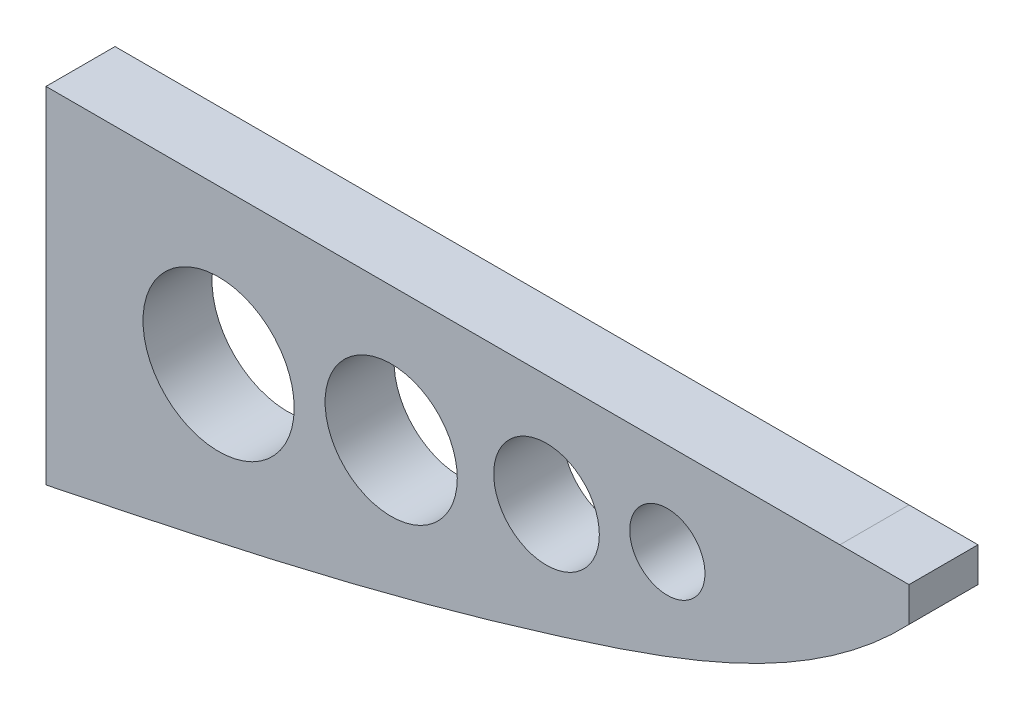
ISO-10303-21;
HEADER;
FILE_DESCRIPTION(('STEP AP214'),'2;1');
FILE_NAME('part.step','',(''),(''),'','','');
FILE_SCHEMA(('AUTOMOTIVE_DESIGN { 1 0 10303 214 1 1 1 1 }'));
ENDSEC;
DATA;
#1=APPLICATION_CONTEXT('core data for automotive mechanical design processes');
#2=APPLICATION_PROTOCOL_DEFINITION('international standard','automotive_design',2000,#1);
#3=PRODUCT_CONTEXT('',#1,'mechanical');
#4=PRODUCT('Part','Part','',(#3));
#5=PRODUCT_RELATED_PRODUCT_CATEGORY('part','',(#4));
#6=PRODUCT_DEFINITION_FORMATION('','',#4);
#7=PRODUCT_DEFINITION_CONTEXT('part definition',#1,'design');
#8=PRODUCT_DEFINITION('design','',#6,#7);
#9=PRODUCT_DEFINITION_SHAPE('','',#8);
#10=(LENGTH_UNIT() NAMED_UNIT(*) SI_UNIT(.MILLI.,.METRE.));
#11=(NAMED_UNIT(*) PLANE_ANGLE_UNIT() SI_UNIT($,.RADIAN.));
#12=(NAMED_UNIT(*) SI_UNIT($,.STERADIAN.) SOLID_ANGLE_UNIT());
#13=UNCERTAINTY_MEASURE_WITH_UNIT(LENGTH_MEASURE(1.E-05),#10,'distance_accuracy_value','');
#14=(GEOMETRIC_REPRESENTATION_CONTEXT(3) GLOBAL_UNCERTAINTY_ASSIGNED_CONTEXT((#13)) GLOBAL_UNIT_ASSIGNED_CONTEXT((#10,
#11,#12)) REPRESENTATION_CONTEXT('',''));
#15=CARTESIAN_POINT('',(0.,0.,0.));
#16=DIRECTION('',(0.,0.,1.));
#17=DIRECTION('',(1.,0.,0.));
#18=AXIS2_PLACEMENT_3D('',#15,#16,#17);
#19=CARTESIAN_POINT('',(0.,50.,20.));
#20=DIRECTION('',(0.,1.,0.));
#21=DIRECTION('',(0.,0.,1.));
#22=AXIS2_PLACEMENT_3D('',#19,#20,#21);
#23=PLANE('',#22);
#24=DIRECTION('',(1.,0.,0.));
#25=VECTOR('',#24,1.);
#26=CARTESIAN_POINT('',(0.,50.,0.));
#27=LINE('',#26,#25);
#28=CARTESIAN_POINT('',(230.,50.,0.));
#29=VERTEX_POINT('',#28);
#30=CARTESIAN_POINT('',(250.,50.,0.));
#31=VERTEX_POINT('',#30);
#32=EDGE_CURVE('E129',#29,#31,#27,.T.);
#33=ORIENTED_EDGE('',*,*,#32,.F.);
#34=DIRECTION('',(0.,0.,1.));
#35=VECTOR('',#34,1.);
#36=CARTESIAN_POINT('',(230.,50.,20.));
#37=LINE('',#36,#35);
#38=CARTESIAN_POINT('',(230.,50.,20.));
#39=VERTEX_POINT('',#38);
#40=EDGE_CURVE('E11',#29,#39,#37,.T.);
#41=ORIENTED_EDGE('',*,*,#40,.T.);
#42=DIRECTION('',(1.,0.,0.));
#43=VECTOR('',#42,1.);
#44=CARTESIAN_POINT('',(0.,50.,20.));
#45=LINE('',#44,#43);
#46=CARTESIAN_POINT('',(250.,50.,20.));
#47=VERTEX_POINT('',#46);
#48=EDGE_CURVE('E109',#39,#47,#45,.T.);
#49=ORIENTED_EDGE('',*,*,#48,.T.);
#50=DIRECTION('',(0.,0.,-1.));
#51=VECTOR('',#50,1.);
#52=CARTESIAN_POINT('',(250.,50.,20.));
#53=LINE('',#52,#51);
#54=EDGE_CURVE('E105',#47,#31,#53,.T.);
#55=ORIENTED_EDGE('',*,*,#54,.T.);
#56=EDGE_LOOP('',(#33,#41,#49,#55));
#57=FACE_BOUND('',#56,.T.);
#58=ADVANCED_FACE('F42',(#57),#23,.T.);
#59=CARTESIAN_POINT('',(0.,-50.,20.));
#60=CARTESIAN_POINT('',(33.4199486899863,-43.0608583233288,20.));
#61=CARTESIAN_POINT('',(83.9632555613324,-32.5541977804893,20.));
#62=CARTESIAN_POINT('',(169.944017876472,-7.88320989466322,20.));
#63=CARTESIAN_POINT('',(222.615387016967,11.374413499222,20.));
#64=CARTESIAN_POINT('',(250.,40.,20.));
#65=B_SPLINE_CURVE_WITH_KNOTS('',3,(#59,#60,#61,#62,#63,#64),.UNSPECIFIED.,.F.,.F.,(4,1,1,4),
(0.,0.381514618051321,0.575066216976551,1.),.UNSPECIFIED.);
#66=DIRECTION('',(0.,0.,-1.));
#67=VECTOR('',#66,1.);
#68=SURFACE_OF_LINEAR_EXTRUSION('',#65,#67);
#69=CARTESIAN_POINT('',(0.,-50.,0.));
#70=CARTESIAN_POINT('',(33.4199486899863,-43.0608583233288,0.));
#71=CARTESIAN_POINT('',(83.9632555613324,-32.5541977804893,0.));
#72=CARTESIAN_POINT('',(169.944017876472,-7.88320989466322,0.));
#73=CARTESIAN_POINT('',(222.615387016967,11.374413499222,0.));
#74=CARTESIAN_POINT('',(250.,40.,0.));
#75=B_SPLINE_CURVE_WITH_KNOTS('',3,(#69,#70,#71,#72,#73,#74),.UNSPECIFIED.,.F.,.F.,(4,1,1,4),
(0.,0.381514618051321,0.575066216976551,1.),.UNSPECIFIED.);
#76=CARTESIAN_POINT('',(0.,-50.,0.));
#77=VERTEX_POINT('',#76);
#78=CARTESIAN_POINT('',(250.,40.,0.));
#79=VERTEX_POINT('',#78);
#80=EDGE_CURVE('E101',#77,#79,#75,.T.);
#81=ORIENTED_EDGE('',*,*,#80,.T.);
#82=DIRECTION('',(0.,0.,-1.));
#83=VECTOR('',#82,1.);
#84=CARTESIAN_POINT('',(250.,40.,20.));
#85=LINE('',#84,#83);
#86=CARTESIAN_POINT('',(250.,40.,20.));
#87=VERTEX_POINT('',#86);
#88=EDGE_CURVE('E52',#87,#79,#85,.T.);
#89=ORIENTED_EDGE('',*,*,#88,.F.);
#90=CARTESIAN_POINT('',(0.,-50.,20.));
#91=VERTEX_POINT('',#90);
#92=EDGE_CURVE('E89',#91,#87,#65,.T.);
#93=ORIENTED_EDGE('',*,*,#92,.F.);
#94=DIRECTION('',(0.,0.,-1.));
#95=VECTOR('',#94,1.);
#96=CARTESIAN_POINT('',(0.,-50.,20.));
#97=LINE('',#96,#95);
#98=EDGE_CURVE('E119',#91,#77,#97,.T.);
#99=ORIENTED_EDGE('',*,*,#98,.T.);
#100=EDGE_LOOP('',(#81,#89,#93,#99));
#101=FACE_BOUND('',#100,.T.);
#102=ADVANCED_FACE('F44',(#101),#68,.F.);
#103=CARTESIAN_POINT('',(250.,50.,20.));
#104=DIRECTION('',(1.,0.,0.));
#105=DIRECTION('',(0.,0.,-1.));
#106=AXIS2_PLACEMENT_3D('',#103,#104,#105);
#107=PLANE('',#106);
#108=DIRECTION('',(0.,-1.,0.));
#109=VECTOR('',#108,1.);
#110=CARTESIAN_POINT('',(250.,50.,0.));
#111=LINE('',#110,#109);
#112=EDGE_CURVE('E123',#31,#79,#111,.T.);
#113=ORIENTED_EDGE('',*,*,#112,.F.);
#114=ORIENTED_EDGE('',*,*,#54,.F.);
#115=DIRECTION('',(0.,-1.,0.));
#116=VECTOR('',#115,1.);
#117=CARTESIAN_POINT('',(250.,50.,20.));
#118=LINE('',#117,#116);
#119=EDGE_CURVE('E93',#47,#87,#118,.T.);
#120=ORIENTED_EDGE('',*,*,#119,.T.);
#121=ORIENTED_EDGE('',*,*,#88,.T.);
#122=EDGE_LOOP('',(#113,#114,#120,#121));
#123=FACE_BOUND('',#122,.T.);
#124=ADVANCED_FACE('F107',(#123),#107,.T.);
#125=ORIENTED_EDGE('',*,*,#40,.F.);
#126=CARTESIAN_POINT('',(0.,50.,0.));
#127=VERTEX_POINT('',#126);
#128=EDGE_CURVE('E130',#127,#29,#27,.T.);
#129=ORIENTED_EDGE('',*,*,#128,.F.);
#130=DIRECTION('',(0.,0.,-1.));
#131=VECTOR('',#130,1.);
#132=CARTESIAN_POINT('',(0.,50.,20.));
#133=LINE('',#132,#131);
#134=CARTESIAN_POINT('',(0.,50.,20.));
#135=VERTEX_POINT('',#134);
#136=EDGE_CURVE('E136',#135,#127,#133,.T.);
#137=ORIENTED_EDGE('',*,*,#136,.F.);
#138=EDGE_CURVE('E111',#135,#39,#45,.T.);
#139=ORIENTED_EDGE('',*,*,#138,.T.);
#140=EDGE_LOOP('',(#125,#129,#137,#139));
#141=FACE_BOUND('',#140,.T.);
#142=ADVANCED_FACE('F141',(#141),#23,.T.);
#143=CARTESIAN_POINT('',(0.,-50.,20.));
#144=DIRECTION('',(-1.,0.,0.));
#145=DIRECTION('',(0.,0.,1.));
#146=AXIS2_PLACEMENT_3D('',#143,#144,#145);
#147=PLANE('',#146);
#148=DIRECTION('',(0.,1.,0.));
#149=VECTOR('',#148,1.);
#150=CARTESIAN_POINT('',(0.,-50.,0.));
#151=LINE('',#150,#149);
#152=EDGE_CURVE('E98',#77,#127,#151,.T.);
#153=ORIENTED_EDGE('',*,*,#152,.F.);
#154=ORIENTED_EDGE('',*,*,#98,.F.);
#155=DIRECTION('',(0.,1.,0.));
#156=VECTOR('',#155,1.);
#157=CARTESIAN_POINT('',(0.,-50.,20.));
#158=LINE('',#157,#156);
#159=EDGE_CURVE('E96',#91,#135,#158,.T.);
#160=ORIENTED_EDGE('',*,*,#159,.T.);
#161=ORIENTED_EDGE('',*,*,#136,.T.);
#162=EDGE_LOOP('',(#153,#154,#160,#161));
#163=FACE_BOUND('',#162,.T.);
#164=ADVANCED_FACE('F143',(#163),#147,.T.);
#165=CARTESIAN_POINT('',(130.668210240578,-19.0333420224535,20.));
#166=DIRECTION('',(0.,0.,-1.));
#167=DIRECTION('',(-1.,0.,0.));
#168=AXIS2_PLACEMENT_3D('',#165,#166,#167);
#169=PLANE('',#168);
#170=CARTESIAN_POINT('',(50.,5.30000000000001,20.));
#171=DIRECTION('',(0.,0.,1.));
#172=DIRECTION('',(1.,0.,0.));
#173=AXIS2_PLACEMENT_3D('',#170,#171,#172);
#174=CIRCLE('',#173,21.9);
#175=CARTESIAN_POINT('',(71.9,5.30000000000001,20.));
#176=VERTEX_POINT('',#175);
#177=EDGE_CURVE('E237',#176,#176,#174,.T.);
#178=ORIENTED_EDGE('',*,*,#177,.F.);
#179=EDGE_LOOP('',(#178));
#180=FACE_BOUND('',#179,.T.);
#181=CARTESIAN_POINT('',(100.,11.25,20.));
#182=DIRECTION('',(0.,0.,1.));
#183=DIRECTION('',(1.,0.,0.));
#184=AXIS2_PLACEMENT_3D('',#181,#182,#183);
#185=CIRCLE('',#184,19.15);
#186=CARTESIAN_POINT('',(119.15,11.25,20.));
#187=VERTEX_POINT('',#186);
#188=EDGE_CURVE('E239',#187,#187,#185,.T.);
#189=ORIENTED_EDGE('',*,*,#188,.F.);
#190=EDGE_LOOP('',(#189));
#191=FACE_BOUND('',#190,.T.);
#192=CARTESIAN_POINT('',(180.,23.2225850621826,20.));
#193=DIRECTION('',(0.,0.,1.));
#194=DIRECTION('',(1.,0.,0.));
#195=AXIS2_PLACEMENT_3D('',#192,#193,#194);
#196=CIRCLE('',#195,10.9);
#197=CARTESIAN_POINT('',(190.9,23.2225850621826,20.));
#198=VERTEX_POINT('',#197);
#199=EDGE_CURVE('E245',#198,#198,#196,.T.);
#200=ORIENTED_EDGE('',*,*,#199,.F.);
#201=EDGE_LOOP('',(#200));
#202=FACE_BOUND('',#201,.T.);
#203=CARTESIAN_POINT('',(145.,17.6604722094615,20.));
#204=DIRECTION('',(0.,0.,1.));
#205=DIRECTION('',(1.,0.,0.));
#206=AXIS2_PLACEMENT_3D('',#203,#204,#205);
#207=CIRCLE('',#206,15.3);
#208=CARTESIAN_POINT('',(160.3,17.6604722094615,20.));
#209=VERTEX_POINT('',#208);
#210=EDGE_CURVE('E251',#209,#209,#207,.T.);
#211=ORIENTED_EDGE('',*,*,#210,.F.);
#212=EDGE_LOOP('',(#211));
#213=FACE_BOUND('',#212,.T.);
#214=ORIENTED_EDGE('',*,*,#92,.T.);
#215=ORIENTED_EDGE('',*,*,#119,.F.);
#216=ORIENTED_EDGE('',*,*,#48,.F.);
#217=ORIENTED_EDGE('',*,*,#138,.F.);
#218=ORIENTED_EDGE('',*,*,#159,.F.);
#219=EDGE_LOOP('',(#214,#215,#216,#217,#218));
#220=FACE_BOUND('',#219,.T.);
#221=ADVANCED_FACE('F91',(#180,#191,#202,#213,#220),#169,.F.);
#222=CARTESIAN_POINT('',(130.668210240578,-19.0333420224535,0.));
#223=DIRECTION('',(0.,0.,-1.));
#224=DIRECTION('',(-1.,0.,0.));
#225=AXIS2_PLACEMENT_3D('',#222,#223,#224);
#226=PLANE('',#225);
#227=CARTESIAN_POINT('',(50.,5.30000000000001,0.));
#228=DIRECTION('',(0.,0.,1.));
#229=DIRECTION('',(1.,0.,0.));
#230=AXIS2_PLACEMENT_3D('',#227,#228,#229);
#231=CIRCLE('',#230,21.9);
#232=CARTESIAN_POINT('',(71.9,5.30000000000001,0.));
#233=VERTEX_POINT('',#232);
#234=EDGE_CURVE('E234',#233,#233,#231,.T.);
#235=ORIENTED_EDGE('',*,*,#234,.T.);
#236=EDGE_LOOP('',(#235));
#237=FACE_BOUND('',#236,.T.);
#238=CARTESIAN_POINT('',(100.,11.25,0.));
#239=DIRECTION('',(0.,0.,1.));
#240=DIRECTION('',(1.,0.,0.));
#241=AXIS2_PLACEMENT_3D('',#238,#239,#240);
#242=CIRCLE('',#241,19.15);
#243=CARTESIAN_POINT('',(119.15,11.25,0.));
#244=VERTEX_POINT('',#243);
#245=EDGE_CURVE('E242',#244,#244,#242,.T.);
#246=ORIENTED_EDGE('',*,*,#245,.T.);
#247=EDGE_LOOP('',(#246));
#248=FACE_BOUND('',#247,.T.);
#249=CARTESIAN_POINT('',(180.,23.2225850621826,0.));
#250=DIRECTION('',(0.,0.,1.));
#251=DIRECTION('',(1.,0.,0.));
#252=AXIS2_PLACEMENT_3D('',#249,#250,#251);
#253=CIRCLE('',#252,10.9);
#254=CARTESIAN_POINT('',(190.9,23.2225850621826,0.));
#255=VERTEX_POINT('',#254);
#256=EDGE_CURVE('E248',#255,#255,#253,.T.);
#257=ORIENTED_EDGE('',*,*,#256,.T.);
#258=EDGE_LOOP('',(#257));
#259=FACE_BOUND('',#258,.T.);
#260=CARTESIAN_POINT('',(145.,17.6604722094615,0.));
#261=DIRECTION('',(0.,0.,1.));
#262=DIRECTION('',(1.,0.,0.));
#263=AXIS2_PLACEMENT_3D('',#260,#261,#262);
#264=CIRCLE('',#263,15.3);
#265=CARTESIAN_POINT('',(160.3,17.6604722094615,0.));
#266=VERTEX_POINT('',#265);
#267=EDGE_CURVE('E124',#266,#266,#264,.T.);
#268=ORIENTED_EDGE('',*,*,#267,.T.);
#269=EDGE_LOOP('',(#268));
#270=FACE_BOUND('',#269,.T.);
#271=ORIENTED_EDGE('',*,*,#80,.F.);
#272=ORIENTED_EDGE('',*,*,#152,.T.);
#273=ORIENTED_EDGE('',*,*,#128,.T.);
#274=ORIENTED_EDGE('',*,*,#32,.T.);
#275=ORIENTED_EDGE('',*,*,#112,.T.);
#276=EDGE_LOOP('',(#271,#272,#273,#274,#275));
#277=FACE_BOUND('',#276,.T.);
#278=ADVANCED_FACE('F139',(#237,#248,#259,#270,#277),#226,.T.);
#279=CARTESIAN_POINT('',(145.,17.6604722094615,0.));
#280=DIRECTION('',(0.,0.,1.));
#281=DIRECTION('',(1.,0.,0.));
#282=AXIS2_PLACEMENT_3D('',#279,#280,#281);
#283=CYLINDRICAL_SURFACE('',#282,15.3);
#284=ORIENTED_EDGE('',*,*,#267,.F.);
#285=EDGE_LOOP('',(#284));
#286=FACE_BOUND('',#285,.T.);
#287=ORIENTED_EDGE('',*,*,#210,.T.);
#288=EDGE_LOOP('',(#287));
#289=FACE_BOUND('',#288,.T.);
#290=ADVANCED_FACE('F188',(#286,#289),#283,.F.);
#291=CARTESIAN_POINT('',(180.,23.2225850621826,0.));
#292=DIRECTION('',(0.,0.,1.));
#293=DIRECTION('',(1.,0.,0.));
#294=AXIS2_PLACEMENT_3D('',#291,#292,#293);
#295=CYLINDRICAL_SURFACE('',#294,10.9);
#296=ORIENTED_EDGE('',*,*,#256,.F.);
#297=EDGE_LOOP('',(#296));
#298=FACE_BOUND('',#297,.T.);
#299=ORIENTED_EDGE('',*,*,#199,.T.);
#300=EDGE_LOOP('',(#299));
#301=FACE_BOUND('',#300,.T.);
#302=ADVANCED_FACE('F197',(#298,#301),#295,.F.);
#303=CARTESIAN_POINT('',(100.,11.25,0.));
#304=DIRECTION('',(0.,0.,1.));
#305=DIRECTION('',(1.,0.,0.));
#306=AXIS2_PLACEMENT_3D('',#303,#304,#305);
#307=CYLINDRICAL_SURFACE('',#306,19.15);
#308=ORIENTED_EDGE('',*,*,#245,.F.);
#309=EDGE_LOOP('',(#308));
#310=FACE_BOUND('',#309,.T.);
#311=ORIENTED_EDGE('',*,*,#188,.T.);
#312=EDGE_LOOP('',(#311));
#313=FACE_BOUND('',#312,.T.);
#314=ADVANCED_FACE('F207',(#310,#313),#307,.F.);
#315=CARTESIAN_POINT('',(50.,5.30000000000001,0.));
#316=DIRECTION('',(0.,0.,1.));
#317=DIRECTION('',(1.,0.,0.));
#318=AXIS2_PLACEMENT_3D('',#315,#316,#317);
#319=CYLINDRICAL_SURFACE('',#318,21.9);
#320=ORIENTED_EDGE('',*,*,#234,.F.);
#321=EDGE_LOOP('',(#320));
#322=FACE_BOUND('',#321,.T.);
#323=ORIENTED_EDGE('',*,*,#177,.T.);
#324=EDGE_LOOP('',(#323));
#325=FACE_BOUND('',#324,.T.);
#326=ADVANCED_FACE('F217',(#322,#325),#319,.F.);
#327=CLOSED_SHELL('',(#58,#102,#124,#142,#164,#221,#278,#290,#302,#314,#326));
#328=MANIFOLD_SOLID_BREP('B2',#327);
#329=ADVANCED_BREP_SHAPE_REPRESENTATION('',(#18,#328),#14);
#330=SHAPE_DEFINITION_REPRESENTATION(#9,#329);
ENDSEC;
END-ISO-10303-21;
